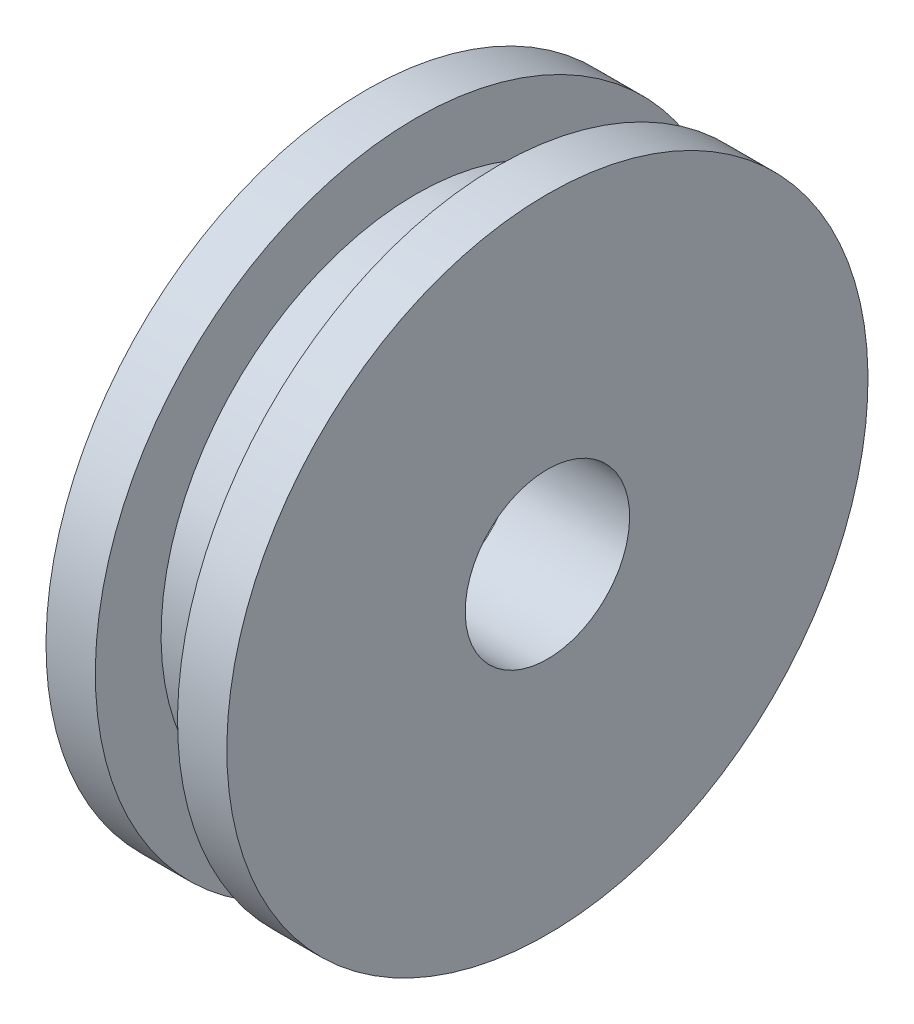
ISO-10303-21;
HEADER;
FILE_DESCRIPTION(('STEP AP214'),'2;1');
FILE_NAME('part.step','',(''),(''),'','','');
FILE_SCHEMA(('AUTOMOTIVE_DESIGN { 1 0 10303 214 1 1 1 1 }'));
ENDSEC;
DATA;
#1=APPLICATION_CONTEXT('core data for automotive mechanical design processes');
#2=APPLICATION_PROTOCOL_DEFINITION('international standard','automotive_design',2000,#1);
#3=PRODUCT_CONTEXT('',#1,'mechanical');
#4=PRODUCT('Part','Part','',(#3));
#5=PRODUCT_RELATED_PRODUCT_CATEGORY('part','',(#4));
#6=PRODUCT_DEFINITION_FORMATION('','',#4);
#7=PRODUCT_DEFINITION_CONTEXT('part definition',#1,'design');
#8=PRODUCT_DEFINITION('design','',#6,#7);
#9=PRODUCT_DEFINITION_SHAPE('','',#8);
#10=(LENGTH_UNIT() NAMED_UNIT(*) SI_UNIT(.MILLI.,.METRE.));
#11=(NAMED_UNIT(*) PLANE_ANGLE_UNIT() SI_UNIT($,.RADIAN.));
#12=(NAMED_UNIT(*) SI_UNIT($,.STERADIAN.) SOLID_ANGLE_UNIT());
#13=UNCERTAINTY_MEASURE_WITH_UNIT(LENGTH_MEASURE(1.E-05),#10,'distance_accuracy_value','');
#14=(GEOMETRIC_REPRESENTATION_CONTEXT(3) GLOBAL_UNCERTAINTY_ASSIGNED_CONTEXT((#13)) GLOBAL_UNIT_ASSIGNED_CONTEXT((#10,
#11,#12)) REPRESENTATION_CONTEXT('',''));
#15=CARTESIAN_POINT('',(0.,0.,0.));
#16=DIRECTION('',(0.,0.,1.));
#17=DIRECTION('',(1.,0.,0.));
#18=AXIS2_PLACEMENT_3D('',#15,#16,#17);
#19=CARTESIAN_POINT('',(15.4371992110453,0.,0.));
#20=DIRECTION('',(1.,0.,0.));
#21=DIRECTION('',(0.,1.,0.));
#22=AXIS2_PLACEMENT_3D('',#19,#20,#21);
#23=CYLINDRICAL_SURFACE('',#22,2.5);
#24=CARTESIAN_POINT('',(20.9371992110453,0.,0.));
#25=DIRECTION('',(1.,0.,0.));
#26=DIRECTION('',(0.,1.,0.));
#27=AXIS2_PLACEMENT_3D('',#24,#25,#26);
#28=CIRCLE('',#27,2.5);
#29=CARTESIAN_POINT('',(20.9371992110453,2.5,0.));
#30=VERTEX_POINT('',#29);
#31=EDGE_CURVE('E46',#30,#30,#28,.T.);
#32=ORIENTED_EDGE('',*,*,#31,.T.);
#33=EDGE_LOOP('',(#32));
#34=FACE_BOUND('',#33,.T.);
#35=CARTESIAN_POINT('',(17.4371992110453,0.,0.));
#36=DIRECTION('',(-1.,0.,0.));
#37=DIRECTION('',(0.,-1.,0.));
#38=AXIS2_PLACEMENT_3D('',#35,#36,#37);
#39=CIRCLE('',#38,2.5);
#40=CARTESIAN_POINT('',(17.4371992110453,-2.5,0.));
#41=VERTEX_POINT('',#40);
#42=EDGE_CURVE('E44',#41,#41,#39,.F.);
#43=ORIENTED_EDGE('',*,*,#42,.F.);
#44=EDGE_LOOP('',(#43));
#45=FACE_BOUND('',#44,.T.);
#46=ADVANCED_FACE('F26',(#34,#45),#23,.F.);
#47=CARTESIAN_POINT('',(15.4371992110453,0.,0.));
#48=DIRECTION('',(-1.,0.,0.));
#49=DIRECTION('',(0.,-1.,0.));
#50=AXIS2_PLACEMENT_3D('',#47,#48,#49);
#51=PLANE('',#50);
#52=CARTESIAN_POINT('',(15.4371992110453,0.,0.));
#53=DIRECTION('',(-1.,0.,0.));
#54=DIRECTION('',(0.,-1.,0.));
#55=AXIS2_PLACEMENT_3D('',#52,#53,#54);
#56=CIRCLE('',#55,6.5);
#57=CARTESIAN_POINT('',(15.4371992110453,-6.49999999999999,0.));
#58=VERTEX_POINT('',#57);
#59=EDGE_CURVE('E10',#58,#58,#56,.F.);
#60=ORIENTED_EDGE('',*,*,#59,.T.);
#61=EDGE_LOOP('',(#60));
#62=FACE_BOUND('',#61,.T.);
#63=CARTESIAN_POINT('',(15.4371992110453,0.,0.));
#64=DIRECTION('',(1.,0.,0.));
#65=DIRECTION('',(0.,1.,0.));
#66=AXIS2_PLACEMENT_3D('',#63,#64,#65);
#67=CIRCLE('',#66,9.75);
#68=CARTESIAN_POINT('',(15.4371992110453,9.75,0.));
#69=VERTEX_POINT('',#68);
#70=EDGE_CURVE('E37',#69,#69,#67,.T.);
#71=ORIENTED_EDGE('',*,*,#70,.F.);
#72=EDGE_LOOP('',(#71));
#73=FACE_BOUND('',#72,.T.);
#74=ADVANCED_FACE('F28',(#62,#73),#51,.T.);
#75=CARTESIAN_POINT('',(20.9371992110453,0.,0.));
#76=DIRECTION('',(1.,0.,0.));
#77=DIRECTION('',(0.,1.,0.));
#78=AXIS2_PLACEMENT_3D('',#75,#76,#77);
#79=CYLINDRICAL_SURFACE('',#78,9.75);
#80=ORIENTED_EDGE('',*,*,#70,.T.);
#81=EDGE_LOOP('',(#80));
#82=FACE_BOUND('',#81,.T.);
#83=CARTESIAN_POINT('',(16.9371992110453,0.,0.));
#84=DIRECTION('',(1.,0.,0.));
#85=DIRECTION('',(0.,1.,0.));
#86=AXIS2_PLACEMENT_3D('',#83,#84,#85);
#87=CIRCLE('',#86,9.75);
#88=CARTESIAN_POINT('',(16.9371992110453,9.74999999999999,0.));
#89=VERTEX_POINT('',#88);
#90=EDGE_CURVE('E41',#89,#89,#87,.T.);
#91=ORIENTED_EDGE('',*,*,#90,.F.);
#92=EDGE_LOOP('',(#91));
#93=FACE_BOUND('',#92,.T.);
#94=ADVANCED_FACE('F89',(#82,#93),#79,.T.);
#95=CARTESIAN_POINT('',(16.9371992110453,9.75,0.));
#96=DIRECTION('',(1.,0.,0.));
#97=DIRECTION('',(0.,1.,0.));
#98=AXIS2_PLACEMENT_3D('',#95,#96,#97);
#99=PLANE('',#98);
#100=ORIENTED_EDGE('',*,*,#90,.T.);
#101=EDGE_LOOP('',(#100));
#102=FACE_BOUND('',#101,.T.);
#103=CARTESIAN_POINT('',(16.9371992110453,0.,0.));
#104=DIRECTION('',(1.,0.,0.));
#105=DIRECTION('',(0.,1.,0.));
#106=AXIS2_PLACEMENT_3D('',#103,#104,#105);
#107=CIRCLE('',#106,7.75);
#108=CARTESIAN_POINT('',(16.9371992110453,7.74999999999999,0.));
#109=VERTEX_POINT('',#108);
#110=EDGE_CURVE('E51',#109,#109,#107,.T.);
#111=ORIENTED_EDGE('',*,*,#110,.F.);
#112=EDGE_LOOP('',(#111));
#113=FACE_BOUND('',#112,.T.);
#114=ADVANCED_FACE('F106',(#102,#113),#99,.T.);
#115=CARTESIAN_POINT('',(20.9371992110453,0.,0.));
#116=DIRECTION('',(1.,0.,0.));
#117=DIRECTION('',(0.,1.,0.));
#118=AXIS2_PLACEMENT_3D('',#115,#116,#117);
#119=CYLINDRICAL_SURFACE('',#118,7.75);
#120=ORIENTED_EDGE('',*,*,#110,.T.);
#121=EDGE_LOOP('',(#120));
#122=FACE_BOUND('',#121,.T.);
#123=CARTESIAN_POINT('',(19.4371992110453,0.,0.));
#124=DIRECTION('',(1.,0.,0.));
#125=DIRECTION('',(0.,1.,0.));
#126=AXIS2_PLACEMENT_3D('',#123,#124,#125);
#127=CIRCLE('',#126,7.75);
#128=CARTESIAN_POINT('',(19.4371992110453,7.75,0.));
#129=VERTEX_POINT('',#128);
#130=EDGE_CURVE('E54',#129,#129,#127,.T.);
#131=ORIENTED_EDGE('',*,*,#130,.F.);
#132=EDGE_LOOP('',(#131));
#133=FACE_BOUND('',#132,.T.);
#134=ADVANCED_FACE('F102',(#122,#133),#119,.T.);
#135=CARTESIAN_POINT('',(19.4371992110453,9.74999999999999,0.));
#136=DIRECTION('',(-1.,0.,0.));
#137=DIRECTION('',(0.,-1.,0.));
#138=AXIS2_PLACEMENT_3D('',#135,#136,#137);
#139=PLANE('',#138);
#140=ORIENTED_EDGE('',*,*,#130,.T.);
#141=EDGE_LOOP('',(#140));
#142=FACE_BOUND('',#141,.T.);
#143=CARTESIAN_POINT('',(19.4371992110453,0.,0.));
#144=DIRECTION('',(1.,0.,0.));
#145=DIRECTION('',(0.,1.,0.));
#146=AXIS2_PLACEMENT_3D('',#143,#144,#145);
#147=CIRCLE('',#146,9.75);
#148=CARTESIAN_POINT('',(19.4371992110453,9.75,0.));
#149=VERTEX_POINT('',#148);
#150=EDGE_CURVE('E57',#149,#149,#147,.T.);
#151=ORIENTED_EDGE('',*,*,#150,.F.);
#152=EDGE_LOOP('',(#151));
#153=FACE_BOUND('',#152,.T.);
#154=ADVANCED_FACE('F98',(#142,#153),#139,.T.);
#155=CARTESIAN_POINT('',(20.9371992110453,0.,0.));
#156=DIRECTION('',(1.,0.,0.));
#157=DIRECTION('',(0.,1.,0.));
#158=AXIS2_PLACEMENT_3D('',#155,#156,#157);
#159=CYLINDRICAL_SURFACE('',#158,9.75);
#160=ORIENTED_EDGE('',*,*,#150,.T.);
#161=EDGE_LOOP('',(#160));
#162=FACE_BOUND('',#161,.T.);
#163=CARTESIAN_POINT('',(20.9371992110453,0.,0.));
#164=DIRECTION('',(1.,0.,0.));
#165=DIRECTION('',(0.,1.,0.));
#166=AXIS2_PLACEMENT_3D('',#163,#164,#165);
#167=CIRCLE('',#166,9.75);
#168=CARTESIAN_POINT('',(20.9371992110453,9.75,0.));
#169=VERTEX_POINT('',#168);
#170=EDGE_CURVE('E60',#169,#169,#167,.T.);
#171=ORIENTED_EDGE('',*,*,#170,.F.);
#172=EDGE_LOOP('',(#171));
#173=FACE_BOUND('',#172,.T.);
#174=ADVANCED_FACE('F94',(#162,#173),#159,.T.);
#175=CARTESIAN_POINT('',(20.9371992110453,0.,0.));
#176=DIRECTION('',(1.,0.,0.));
#177=DIRECTION('',(0.,1.,0.));
#178=AXIS2_PLACEMENT_3D('',#175,#176,#177);
#179=PLANE('',#178);
#180=ORIENTED_EDGE('',*,*,#31,.F.);
#181=EDGE_LOOP('',(#180));
#182=FACE_BOUND('',#181,.T.);
#183=ORIENTED_EDGE('',*,*,#170,.T.);
#184=EDGE_LOOP('',(#183));
#185=FACE_BOUND('',#184,.T.);
#186=ADVANCED_FACE('F81',(#182,#185),#179,.T.);
#187=CARTESIAN_POINT('',(17.4371992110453,0.,0.));
#188=DIRECTION('',(-1.,0.,0.));
#189=DIRECTION('',(0.,-1.,0.));
#190=AXIS2_PLACEMENT_3D('',#187,#188,#189);
#191=PLANE('',#190);
#192=CARTESIAN_POINT('',(17.4371992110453,0.,0.));
#193=DIRECTION('',(-1.,0.,0.));
#194=DIRECTION('',(0.,-1.,0.));
#195=AXIS2_PLACEMENT_3D('',#192,#193,#194);
#196=CIRCLE('',#195,6.);
#197=CARTESIAN_POINT('',(17.4371992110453,-6.,0.));
#198=VERTEX_POINT('',#197);
#199=EDGE_CURVE('E47',#198,#198,#196,.T.);
#200=ORIENTED_EDGE('',*,*,#199,.T.);
#201=EDGE_LOOP('',(#200));
#202=FACE_BOUND('',#201,.T.);
#203=ORIENTED_EDGE('',*,*,#42,.T.);
#204=EDGE_LOOP('',(#203));
#205=FACE_BOUND('',#204,.T.);
#206=ADVANCED_FACE('F68',(#202,#205),#191,.T.);
#207=CARTESIAN_POINT('',(17.4371992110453,0.,0.));
#208=DIRECTION('',(-1.,0.,0.));
#209=DIRECTION('',(0.,-1.,0.));
#210=AXIS2_PLACEMENT_3D('',#207,#208,#209);
#211=CYLINDRICAL_SURFACE('',#210,6.);
#212=CARTESIAN_POINT('',(15.9371992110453,0.,0.));
#213=DIRECTION('',(-1.,0.,0.));
#214=DIRECTION('',(0.,-1.,0.));
#215=AXIS2_PLACEMENT_3D('',#212,#213,#214);
#216=CIRCLE('',#215,6.);
#217=CARTESIAN_POINT('',(15.9371992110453,-6.,0.));
#218=VERTEX_POINT('',#217);
#219=EDGE_CURVE('E33',#218,#218,#216,.T.);
#220=ORIENTED_EDGE('',*,*,#219,.T.);
#221=EDGE_LOOP('',(#220));
#222=FACE_BOUND('',#221,.T.);
#223=ORIENTED_EDGE('',*,*,#199,.F.);
#224=EDGE_LOOP('',(#223));
#225=FACE_BOUND('',#224,.T.);
#226=ADVANCED_FACE('F71',(#222,#225),#211,.F.);
#227=CARTESIAN_POINT('',(15.9371992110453,0.,0.));
#228=DIRECTION('',(-1.,0.,0.));
#229=DIRECTION('',(0.,-1.,0.));
#230=AXIS2_PLACEMENT_3D('',#227,#228,#229);
#231=CONICAL_SURFACE('',#230,6.,0.78539816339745);
#232=ORIENTED_EDGE('',*,*,#59,.F.);
#233=EDGE_LOOP('',(#232));
#234=FACE_BOUND('',#233,.T.);
#235=ORIENTED_EDGE('',*,*,#219,.F.);
#236=EDGE_LOOP('',(#235));
#237=FACE_BOUND('',#236,.T.);
#238=ADVANCED_FACE('F73',(#234,#237),#231,.F.);
#239=CLOSED_SHELL('',(#46,#74,#94,#114,#134,#154,#174,#186,#206,#226,#238));
#240=MANIFOLD_SOLID_BREP('B2',#239);
#241=ADVANCED_BREP_SHAPE_REPRESENTATION('',(#18,#240),#14);
#242=SHAPE_DEFINITION_REPRESENTATION(#9,#241);
ENDSEC;
END-ISO-10303-21;
